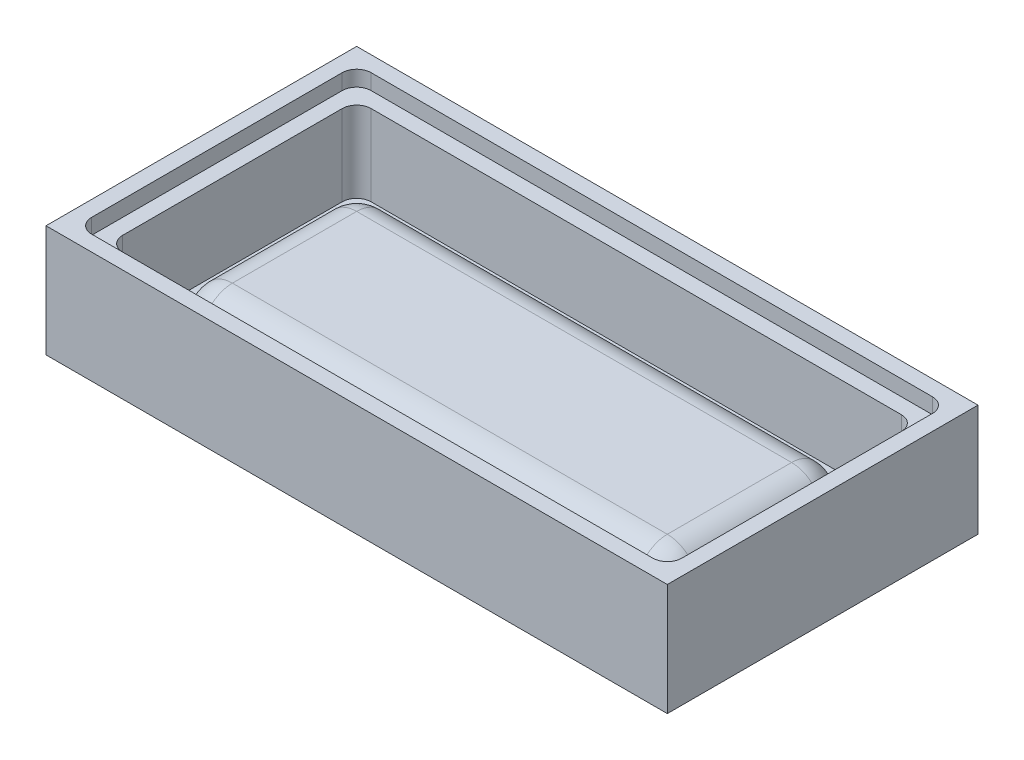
ISO-10303-21;
HEADER;
FILE_DESCRIPTION(('STEP AP214'),'2;1');
FILE_NAME('part.step','',(''),(''),'','','');
FILE_SCHEMA(('AUTOMOTIVE_DESIGN { 1 0 10303 214 1 1 1 1 }'));
ENDSEC;
DATA;
#1=APPLICATION_CONTEXT('core data for automotive mechanical design processes');
#2=APPLICATION_PROTOCOL_DEFINITION('international standard','automotive_design',2000,#1);
#3=PRODUCT_CONTEXT('',#1,'mechanical');
#4=PRODUCT('Part','Part','',(#3));
#5=PRODUCT_RELATED_PRODUCT_CATEGORY('part','',(#4));
#6=PRODUCT_DEFINITION_FORMATION('','',#4);
#7=PRODUCT_DEFINITION_CONTEXT('part definition',#1,'design');
#8=PRODUCT_DEFINITION('design','',#6,#7);
#9=PRODUCT_DEFINITION_SHAPE('','',#8);
#10=(LENGTH_UNIT() NAMED_UNIT(*) SI_UNIT(.MILLI.,.METRE.));
#11=(NAMED_UNIT(*) PLANE_ANGLE_UNIT() SI_UNIT($,.RADIAN.));
#12=(NAMED_UNIT(*) SI_UNIT($,.STERADIAN.) SOLID_ANGLE_UNIT());
#13=UNCERTAINTY_MEASURE_WITH_UNIT(LENGTH_MEASURE(1.E-05),#10,'distance_accuracy_value','');
#14=(GEOMETRIC_REPRESENTATION_CONTEXT(3) GLOBAL_UNCERTAINTY_ASSIGNED_CONTEXT((#13)) GLOBAL_UNIT_ASSIGNED_CONTEXT((#10,
#11,#12)) REPRESENTATION_CONTEXT('',''));
#15=CARTESIAN_POINT('',(0.,0.,0.));
#16=DIRECTION('',(0.,0.,1.));
#17=DIRECTION('',(1.,0.,0.));
#18=AXIS2_PLACEMENT_3D('',#15,#16,#17);
#19=CARTESIAN_POINT('',(85.3357747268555,4.99999999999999,-35.3357747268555));
#20=DIRECTION('',(0.,1.,0.));
#21=DIRECTION('',(0.,0.,1.));
#22=AXIS2_PLACEMENT_3D('',#19,#20,#21);
#23=PLANE('',#22);
#24=CARTESIAN_POINT('',(85.3357747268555,4.99999999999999,-35.3357747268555));
#25=DIRECTION('',(0.,1.,0.));
#26=DIRECTION('',(0.,0.,1.));
#27=AXIS2_PLACEMENT_3D('',#24,#25,#26);
#28=CIRCLE('',#27,4.66422527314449);
#29=CARTESIAN_POINT('',(90.,4.99999999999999,-35.3357747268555));
#30=VERTEX_POINT('',#29);
#31=CARTESIAN_POINT('',(85.3357747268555,4.99999999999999,-40.));
#32=VERTEX_POINT('',#31);
#33=EDGE_CURVE('E239',#30,#32,#28,.T.);
#34=ORIENTED_EDGE('',*,*,#33,.T.);
#35=DIRECTION('',(-1.,0.,0.));
#36=VECTOR('',#35,1.);
#37=CARTESIAN_POINT('',(85.3357747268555,4.99999999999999,-40.));
#38=LINE('',#37,#36);
#39=CARTESIAN_POINT('',(-85.3357747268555,4.99999999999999,-40.));
#40=VERTEX_POINT('',#39);
#41=EDGE_CURVE('E250',#32,#40,#38,.T.);
#42=ORIENTED_EDGE('',*,*,#41,.T.);
#43=CARTESIAN_POINT('',(-85.3357747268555,4.99999999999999,-35.3357747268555));
#44=DIRECTION('',(0.,1.,0.));
#45=DIRECTION('',(0.,0.,-1.));
#46=AXIS2_PLACEMENT_3D('',#43,#44,#45);
#47=CIRCLE('',#46,4.66422527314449);
#48=CARTESIAN_POINT('',(-90.,4.99999999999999,-35.3357747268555));
#49=VERTEX_POINT('',#48);
#50=EDGE_CURVE('E255',#40,#49,#47,.T.);
#51=ORIENTED_EDGE('',*,*,#50,.T.);
#52=DIRECTION('',(0.,0.,1.));
#53=VECTOR('',#52,1.);
#54=CARTESIAN_POINT('',(-90.,4.99999999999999,-35.3357747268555));
#55=LINE('',#54,#53);
#56=CARTESIAN_POINT('',(-90.,4.99999999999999,35.3357747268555));
#57=VERTEX_POINT('',#56);
#58=EDGE_CURVE('E270',#49,#57,#55,.T.);
#59=ORIENTED_EDGE('',*,*,#58,.T.);
#60=CARTESIAN_POINT('',(-85.3357747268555,4.99999999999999,35.3357747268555));
#61=DIRECTION('',(0.,1.,0.));
#62=DIRECTION('',(0.,0.,-1.));
#63=AXIS2_PLACEMENT_3D('',#60,#61,#62);
#64=CIRCLE('',#63,4.66422527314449);
#65=CARTESIAN_POINT('',(-85.3357747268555,4.99999999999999,40.));
#66=VERTEX_POINT('',#65);
#67=EDGE_CURVE('E273',#57,#66,#64,.T.);
#68=ORIENTED_EDGE('',*,*,#67,.T.);
#69=DIRECTION('',(1.,0.,0.));
#70=VECTOR('',#69,1.);
#71=CARTESIAN_POINT('',(-85.3357747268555,4.99999999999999,40.));
#72=LINE('',#71,#70);
#73=CARTESIAN_POINT('',(85.3357747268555,4.99999999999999,40.));
#74=VERTEX_POINT('',#73);
#75=EDGE_CURVE('E276',#66,#74,#72,.T.);
#76=ORIENTED_EDGE('',*,*,#75,.T.);
#77=CARTESIAN_POINT('',(85.3357747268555,4.99999999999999,35.3357747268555));
#78=DIRECTION('',(0.,1.,0.));
#79=DIRECTION('',(0.,0.,-1.));
#80=AXIS2_PLACEMENT_3D('',#77,#78,#79);
#81=CIRCLE('',#80,4.66422527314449);
#82=CARTESIAN_POINT('',(90.,4.99999999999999,35.3357747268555));
#83=VERTEX_POINT('',#82);
#84=EDGE_CURVE('E279',#74,#83,#81,.T.);
#85=ORIENTED_EDGE('',*,*,#84,.T.);
#86=DIRECTION('',(0.,0.,-1.));
#87=VECTOR('',#86,1.);
#88=CARTESIAN_POINT('',(90.,4.99999999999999,35.3357747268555));
#89=LINE('',#88,#87);
#90=EDGE_CURVE('E247',#83,#30,#89,.T.);
#91=ORIENTED_EDGE('',*,*,#90,.T.);
#92=EDGE_LOOP('',(#34,#42,#51,#59,#68,#76,#85,#91));
#93=FACE_BOUND('',#92,.T.);
#94=DIRECTION('',(1.,0.,0.));
#95=VECTOR('',#94,1.);
#96=CARTESIAN_POINT('',(-80.,4.99999999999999,30.));
#97=LINE('',#96,#95);
#98=CARTESIAN_POINT('',(-70.,4.99999999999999,30.));
#99=VERTEX_POINT('',#98);
#100=CARTESIAN_POINT('',(70.,4.99999999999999,30.));
#101=VERTEX_POINT('',#100);
#102=EDGE_CURVE('E478',#99,#101,#97,.T.);
#103=ORIENTED_EDGE('',*,*,#102,.F.);
#104=CARTESIAN_POINT('',(-70.,4.99999999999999,20.));
#105=DIRECTION('',(0.,1.,0.));
#106=DIRECTION('',(0.,0.,1.));
#107=AXIS2_PLACEMENT_3D('',#104,#105,#106);
#108=CIRCLE('',#107,10.);
#109=CARTESIAN_POINT('',(-80.,4.99999999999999,20.));
#110=VERTEX_POINT('',#109);
#111=EDGE_CURVE('E46',#99,#110,#108,.F.);
#112=ORIENTED_EDGE('',*,*,#111,.T.);
#113=DIRECTION('',(0.,0.,1.));
#114=VECTOR('',#113,1.);
#115=CARTESIAN_POINT('',(-80.,4.99999999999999,-30.));
#116=LINE('',#115,#114);
#117=CARTESIAN_POINT('',(-80.,4.99999999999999,-20.));
#118=VERTEX_POINT('',#117);
#119=EDGE_CURVE('E476',#118,#110,#116,.T.);
#120=ORIENTED_EDGE('',*,*,#119,.F.);
#121=CARTESIAN_POINT('',(-70.,4.99999999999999,-20.));
#122=DIRECTION('',(0.,1.,0.));
#123=DIRECTION('',(0.,0.,1.));
#124=AXIS2_PLACEMENT_3D('',#121,#122,#123);
#125=CIRCLE('',#124,10.);
#126=CARTESIAN_POINT('',(-70.,4.99999999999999,-30.));
#127=VERTEX_POINT('',#126);
#128=EDGE_CURVE('E11',#118,#127,#125,.F.);
#129=ORIENTED_EDGE('',*,*,#128,.T.);
#130=DIRECTION('',(-1.,0.,0.));
#131=VECTOR('',#130,1.);
#132=CARTESIAN_POINT('',(80.,4.99999999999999,-30.));
#133=LINE('',#132,#131);
#134=CARTESIAN_POINT('',(70.,4.99999999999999,-30.));
#135=VERTEX_POINT('',#134);
#136=EDGE_CURVE('E266',#135,#127,#133,.T.);
#137=ORIENTED_EDGE('',*,*,#136,.F.);
#138=CARTESIAN_POINT('',(70.,4.99999999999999,-20.));
#139=DIRECTION('',(0.,1.,0.));
#140=DIRECTION('',(0.,0.,1.));
#141=AXIS2_PLACEMENT_3D('',#138,#139,#140);
#142=CIRCLE('',#141,10.);
#143=CARTESIAN_POINT('',(80.,4.99999999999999,-20.));
#144=VERTEX_POINT('',#143);
#145=EDGE_CURVE('E440',#135,#144,#142,.F.);
#146=ORIENTED_EDGE('',*,*,#145,.T.);
#147=DIRECTION('',(0.,0.,-1.));
#148=VECTOR('',#147,1.);
#149=CARTESIAN_POINT('',(80.,4.99999999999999,30.));
#150=LINE('',#149,#148);
#151=CARTESIAN_POINT('',(80.,4.99999999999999,20.));
#152=VERTEX_POINT('',#151);
#153=EDGE_CURVE('E482',#152,#144,#150,.T.);
#154=ORIENTED_EDGE('',*,*,#153,.F.);
#155=CARTESIAN_POINT('',(70.,4.99999999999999,20.));
#156=DIRECTION('',(0.,1.,0.));
#157=DIRECTION('',(0.,0.,1.));
#158=AXIS2_PLACEMENT_3D('',#155,#156,#157);
#159=CIRCLE('',#158,10.);
#160=EDGE_CURVE('E438',#152,#101,#159,.F.);
#161=ORIENTED_EDGE('',*,*,#160,.T.);
#162=EDGE_LOOP('',(#103,#112,#120,#129,#137,#146,#154,#161));
#163=FACE_BOUND('',#162,.T.);
#164=ADVANCED_FACE('F37',(#93,#163),#23,.T.);
#165=CARTESIAN_POINT('',(90.3357747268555,31.,-40.3357747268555));
#166=DIRECTION('',(0.,-1.,0.));
#167=DIRECTION('',(0.,0.,-1.));
#168=AXIS2_PLACEMENT_3D('',#165,#166,#167);
#169=PLANE('',#168);
#170=CARTESIAN_POINT('',(90.3357747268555,31.,-40.3357747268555));
#171=DIRECTION('',(0.,1.,0.));
#172=DIRECTION('',(0.,0.,-1.));
#173=AXIS2_PLACEMENT_3D('',#170,#171,#172);
#174=CIRCLE('',#173,4.6642252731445);
#175=CARTESIAN_POINT('',(95.,31.,-40.3357747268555));
#176=VERTEX_POINT('',#175);
#177=CARTESIAN_POINT('',(90.3357747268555,31.,-45.));
#178=VERTEX_POINT('',#177);
#179=EDGE_CURVE('E313',#176,#178,#174,.T.);
#180=ORIENTED_EDGE('',*,*,#179,.T.);
#181=DIRECTION('',(-1.,0.,0.));
#182=VECTOR('',#181,1.);
#183=CARTESIAN_POINT('',(-90.3357747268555,31.,-45.));
#184=LINE('',#183,#182);
#185=CARTESIAN_POINT('',(-90.3357747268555,31.,-45.));
#186=VERTEX_POINT('',#185);
#187=EDGE_CURVE('E316',#178,#186,#184,.T.);
#188=ORIENTED_EDGE('',*,*,#187,.T.);
#189=CARTESIAN_POINT('',(-90.3357747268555,31.,-40.3357747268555));
#190=DIRECTION('',(0.,1.,0.));
#191=DIRECTION('',(0.,0.,1.));
#192=AXIS2_PLACEMENT_3D('',#189,#190,#191);
#193=CIRCLE('',#192,4.66422527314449);
#194=CARTESIAN_POINT('',(-95.,31.,-40.3357747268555));
#195=VERTEX_POINT('',#194);
#196=EDGE_CURVE('E320',#186,#195,#193,.T.);
#197=ORIENTED_EDGE('',*,*,#196,.T.);
#198=DIRECTION('',(0.,0.,1.));
#199=VECTOR('',#198,1.);
#200=CARTESIAN_POINT('',(-95.,31.,-40.3357747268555));
#201=LINE('',#200,#199);
#202=CARTESIAN_POINT('',(-95.,31.,40.3357747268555));
#203=VERTEX_POINT('',#202);
#204=EDGE_CURVE('E323',#195,#203,#201,.T.);
#205=ORIENTED_EDGE('',*,*,#204,.T.);
#206=CARTESIAN_POINT('',(-90.3357747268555,31.,40.3357747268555));
#207=DIRECTION('',(0.,1.,0.));
#208=DIRECTION('',(0.,0.,1.));
#209=AXIS2_PLACEMENT_3D('',#206,#207,#208);
#210=CIRCLE('',#209,4.66422527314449);
#211=CARTESIAN_POINT('',(-90.3357747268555,31.,45.));
#212=VERTEX_POINT('',#211);
#213=EDGE_CURVE('E326',#203,#212,#210,.T.);
#214=ORIENTED_EDGE('',*,*,#213,.T.);
#215=DIRECTION('',(1.,0.,0.));
#216=VECTOR('',#215,1.);
#217=CARTESIAN_POINT('',(-90.3357747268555,31.,45.));
#218=LINE('',#217,#216);
#219=CARTESIAN_POINT('',(90.3357747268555,31.,45.));
#220=VERTEX_POINT('',#219);
#221=EDGE_CURVE('E329',#212,#220,#218,.T.);
#222=ORIENTED_EDGE('',*,*,#221,.T.);
#223=CARTESIAN_POINT('',(90.3357747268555,31.,40.3357747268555));
#224=DIRECTION('',(0.,1.,0.));
#225=DIRECTION('',(0.,0.,1.));
#226=AXIS2_PLACEMENT_3D('',#223,#224,#225);
#227=CIRCLE('',#226,4.66422527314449);
#228=CARTESIAN_POINT('',(95.,31.,40.3357747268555));
#229=VERTEX_POINT('',#228);
#230=EDGE_CURVE('E332',#220,#229,#227,.T.);
#231=ORIENTED_EDGE('',*,*,#230,.T.);
#232=DIRECTION('',(0.,0.,-1.));
#233=VECTOR('',#232,1.);
#234=CARTESIAN_POINT('',(95.,31.,-40.3357747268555));
#235=LINE('',#234,#233);
#236=EDGE_CURVE('E335',#229,#176,#235,.T.);
#237=ORIENTED_EDGE('',*,*,#236,.T.);
#238=EDGE_LOOP('',(#180,#188,#197,#205,#214,#222,#231,#237));
#239=FACE_BOUND('',#238,.T.);
#240=CARTESIAN_POINT('',(85.3357747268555,31.,-35.3357747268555));
#241=DIRECTION('',(0.,1.,0.));
#242=DIRECTION('',(0.,0.,1.));
#243=AXIS2_PLACEMENT_3D('',#240,#241,#242);
#244=CIRCLE('',#243,4.66422527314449);
#245=CARTESIAN_POINT('',(90.,31.,-35.3357747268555));
#246=VERTEX_POINT('',#245);
#247=CARTESIAN_POINT('',(85.3357747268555,31.,-40.));
#248=VERTEX_POINT('',#247);
#249=EDGE_CURVE('E242',#246,#248,#244,.T.);
#250=ORIENTED_EDGE('',*,*,#249,.F.);
#251=DIRECTION('',(0.,0.,-1.));
#252=VECTOR('',#251,1.);
#253=CARTESIAN_POINT('',(90.,31.,35.3357747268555));
#254=LINE('',#253,#252);
#255=CARTESIAN_POINT('',(90.,31.,35.3357747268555));
#256=VERTEX_POINT('',#255);
#257=EDGE_CURVE('E260',#256,#246,#254,.T.);
#258=ORIENTED_EDGE('',*,*,#257,.F.);
#259=CARTESIAN_POINT('',(85.3357747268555,31.,35.3357747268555));
#260=DIRECTION('',(0.,1.,0.));
#261=DIRECTION('',(0.,0.,-1.));
#262=AXIS2_PLACEMENT_3D('',#259,#260,#261);
#263=CIRCLE('',#262,4.66422527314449);
#264=CARTESIAN_POINT('',(85.3357747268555,31.,40.));
#265=VERTEX_POINT('',#264);
#266=EDGE_CURVE('E263',#265,#256,#263,.T.);
#267=ORIENTED_EDGE('',*,*,#266,.F.);
#268=DIRECTION('',(1.,0.,0.));
#269=VECTOR('',#268,1.);
#270=CARTESIAN_POINT('',(-85.3357747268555,31.,40.));
#271=LINE('',#270,#269);
#272=CARTESIAN_POINT('',(-85.3357747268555,31.,40.));
#273=VERTEX_POINT('',#272);
#274=EDGE_CURVE('E294',#273,#265,#271,.T.);
#275=ORIENTED_EDGE('',*,*,#274,.F.);
#276=CARTESIAN_POINT('',(-85.3357747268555,31.,35.3357747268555));
#277=DIRECTION('',(0.,1.,0.));
#278=DIRECTION('',(0.,0.,-1.));
#279=AXIS2_PLACEMENT_3D('',#276,#277,#278);
#280=CIRCLE('',#279,4.66422527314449);
#281=CARTESIAN_POINT('',(-90.,31.,35.3357747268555));
#282=VERTEX_POINT('',#281);
#283=EDGE_CURVE('E291',#282,#273,#280,.T.);
#284=ORIENTED_EDGE('',*,*,#283,.F.);
#285=DIRECTION('',(0.,0.,1.));
#286=VECTOR('',#285,1.);
#287=CARTESIAN_POINT('',(-90.,31.,-35.3357747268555));
#288=LINE('',#287,#286);
#289=CARTESIAN_POINT('',(-90.,31.,-35.3357747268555));
#290=VERTEX_POINT('',#289);
#291=EDGE_CURVE('E288',#290,#282,#288,.T.);
#292=ORIENTED_EDGE('',*,*,#291,.F.);
#293=CARTESIAN_POINT('',(-85.3357747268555,31.,-35.3357747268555));
#294=DIRECTION('',(0.,1.,0.));
#295=DIRECTION('',(0.,0.,-1.));
#296=AXIS2_PLACEMENT_3D('',#293,#294,#295);
#297=CIRCLE('',#296,4.66422527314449);
#298=CARTESIAN_POINT('',(-85.3357747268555,31.,-40.));
#299=VERTEX_POINT('',#298);
#300=EDGE_CURVE('E285',#299,#290,#297,.T.);
#301=ORIENTED_EDGE('',*,*,#300,.F.);
#302=DIRECTION('',(-1.,0.,0.));
#303=VECTOR('',#302,1.);
#304=CARTESIAN_POINT('',(85.3357747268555,31.,-40.));
#305=LINE('',#304,#303);
#306=EDGE_CURVE('E283',#248,#299,#305,.T.);
#307=ORIENTED_EDGE('',*,*,#306,.F.);
#308=EDGE_LOOP('',(#250,#258,#267,#275,#284,#292,#301,#307));
#309=FACE_BOUND('',#308,.T.);
#310=ADVANCED_FACE('F551',(#239,#309),#169,.F.);
#311=CARTESIAN_POINT('',(100.,36.,-50.));
#312=DIRECTION('',(-1.,0.,0.));
#313=DIRECTION('',(0.,0.,1.));
#314=AXIS2_PLACEMENT_3D('',#311,#312,#313);
#315=PLANE('',#314);
#316=DIRECTION('',(0.,0.,-1.));
#317=VECTOR('',#316,1.);
#318=CARTESIAN_POINT('',(100.,0.,-50.));
#319=LINE('',#318,#317);
#320=CARTESIAN_POINT('',(100.,0.,50.));
#321=VERTEX_POINT('',#320);
#322=CARTESIAN_POINT('',(100.,0.,-50.));
#323=VERTEX_POINT('',#322);
#324=EDGE_CURVE('E362',#321,#323,#319,.T.);
#325=ORIENTED_EDGE('',*,*,#324,.T.);
#326=DIRECTION('',(0.,-1.,0.));
#327=VECTOR('',#326,1.);
#328=CARTESIAN_POINT('',(100.,36.,-50.));
#329=LINE('',#328,#327);
#330=CARTESIAN_POINT('',(100.,36.,-50.));
#331=VERTEX_POINT('',#330);
#332=EDGE_CURVE('E403',#331,#323,#329,.T.);
#333=ORIENTED_EDGE('',*,*,#332,.F.);
#334=DIRECTION('',(0.,0.,-1.));
#335=VECTOR('',#334,1.);
#336=CARTESIAN_POINT('',(100.,36.,-50.));
#337=LINE('',#336,#335);
#338=CARTESIAN_POINT('',(100.,36.,50.));
#339=VERTEX_POINT('',#338);
#340=EDGE_CURVE('E377',#339,#331,#337,.T.);
#341=ORIENTED_EDGE('',*,*,#340,.F.);
#342=DIRECTION('',(0.,-1.,0.));
#343=VECTOR('',#342,1.);
#344=CARTESIAN_POINT('',(100.,36.,50.));
#345=LINE('',#344,#343);
#346=EDGE_CURVE('E387',#339,#321,#345,.T.);
#347=ORIENTED_EDGE('',*,*,#346,.T.);
#348=EDGE_LOOP('',(#325,#333,#341,#347));
#349=FACE_BOUND('',#348,.T.);
#350=ADVANCED_FACE('F556',(#349),#315,.F.);
#351=CARTESIAN_POINT('',(-100.,36.,-50.));
#352=DIRECTION('',(0.,0.,1.));
#353=DIRECTION('',(1.,0.,0.));
#354=AXIS2_PLACEMENT_3D('',#351,#352,#353);
#355=PLANE('',#354);
#356=DIRECTION('',(-1.,0.,0.));
#357=VECTOR('',#356,1.);
#358=CARTESIAN_POINT('',(-100.,0.,-50.));
#359=LINE('',#358,#357);
#360=CARTESIAN_POINT('',(-100.,0.,-50.));
#361=VERTEX_POINT('',#360);
#362=EDGE_CURVE('E390',#323,#361,#359,.T.);
#363=ORIENTED_EDGE('',*,*,#362,.T.);
#364=DIRECTION('',(0.,-1.,0.));
#365=VECTOR('',#364,1.);
#366=CARTESIAN_POINT('',(-100.,36.,-50.));
#367=LINE('',#366,#365);
#368=CARTESIAN_POINT('',(-100.,36.,-50.));
#369=VERTEX_POINT('',#368);
#370=EDGE_CURVE('E400',#369,#361,#367,.T.);
#371=ORIENTED_EDGE('',*,*,#370,.F.);
#372=DIRECTION('',(-1.,0.,0.));
#373=VECTOR('',#372,1.);
#374=CARTESIAN_POINT('',(-100.,36.,-50.));
#375=LINE('',#374,#373);
#376=EDGE_CURVE('E380',#331,#369,#375,.T.);
#377=ORIENTED_EDGE('',*,*,#376,.F.);
#378=ORIENTED_EDGE('',*,*,#332,.T.);
#379=EDGE_LOOP('',(#363,#371,#377,#378));
#380=FACE_BOUND('',#379,.T.);
#381=ADVANCED_FACE('F638',(#380),#355,.F.);
#382=CARTESIAN_POINT('',(-100.,36.,-50.));
#383=DIRECTION('',(1.,0.,0.));
#384=DIRECTION('',(0.,0.,-1.));
#385=AXIS2_PLACEMENT_3D('',#382,#383,#384);
#386=PLANE('',#385);
#387=DIRECTION('',(0.,0.,1.));
#388=VECTOR('',#387,1.);
#389=CARTESIAN_POINT('',(-100.,0.,-50.));
#390=LINE('',#389,#388);
#391=CARTESIAN_POINT('',(-100.,0.,50.));
#392=VERTEX_POINT('',#391);
#393=EDGE_CURVE('E392',#361,#392,#390,.T.);
#394=ORIENTED_EDGE('',*,*,#393,.T.);
#395=DIRECTION('',(0.,-1.,0.));
#396=VECTOR('',#395,1.);
#397=CARTESIAN_POINT('',(-100.,36.,50.));
#398=LINE('',#397,#396);
#399=CARTESIAN_POINT('',(-100.,36.,50.));
#400=VERTEX_POINT('',#399);
#401=EDGE_CURVE('E397',#400,#392,#398,.T.);
#402=ORIENTED_EDGE('',*,*,#401,.F.);
#403=DIRECTION('',(0.,0.,1.));
#404=VECTOR('',#403,1.);
#405=CARTESIAN_POINT('',(-100.,36.,-50.));
#406=LINE('',#405,#404);
#407=EDGE_CURVE('E383',#369,#400,#406,.T.);
#408=ORIENTED_EDGE('',*,*,#407,.F.);
#409=ORIENTED_EDGE('',*,*,#370,.T.);
#410=EDGE_LOOP('',(#394,#402,#408,#409));
#411=FACE_BOUND('',#410,.T.);
#412=ADVANCED_FACE('F634',(#411),#386,.F.);
#413=CARTESIAN_POINT('',(-100.,36.,50.));
#414=DIRECTION('',(0.,0.,-1.));
#415=DIRECTION('',(-1.,0.,0.));
#416=AXIS2_PLACEMENT_3D('',#413,#414,#415);
#417=PLANE('',#416);
#418=DIRECTION('',(1.,0.,0.));
#419=VECTOR('',#418,1.);
#420=CARTESIAN_POINT('',(-100.,0.,50.));
#421=LINE('',#420,#419);
#422=EDGE_CURVE('E381',#392,#321,#421,.T.);
#423=ORIENTED_EDGE('',*,*,#422,.T.);
#424=ORIENTED_EDGE('',*,*,#346,.F.);
#425=DIRECTION('',(1.,0.,0.));
#426=VECTOR('',#425,1.);
#427=CARTESIAN_POINT('',(-100.,36.,50.));
#428=LINE('',#427,#426);
#429=EDGE_CURVE('E385',#400,#339,#428,.T.);
#430=ORIENTED_EDGE('',*,*,#429,.F.);
#431=ORIENTED_EDGE('',*,*,#401,.T.);
#432=EDGE_LOOP('',(#423,#424,#430,#431));
#433=FACE_BOUND('',#432,.T.);
#434=ADVANCED_FACE('F627',(#433),#417,.F.);
#435=CARTESIAN_POINT('',(0.,36.,0.));
#436=DIRECTION('',(0.,1.,0.));
#437=DIRECTION('',(0.,0.,1.));
#438=AXIS2_PLACEMENT_3D('',#435,#436,#437);
#439=PLANE('',#438);
#440=CARTESIAN_POINT('',(90.3357747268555,36.,-40.3357747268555));
#441=DIRECTION('',(0.,1.,0.));
#442=DIRECTION('',(0.,0.,-1.));
#443=AXIS2_PLACEMENT_3D('',#440,#441,#442);
#444=CIRCLE('',#443,4.6642252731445);
#445=CARTESIAN_POINT('',(95.,36.,-40.3357747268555));
#446=VERTEX_POINT('',#445);
#447=CARTESIAN_POINT('',(90.3357747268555,36.,-45.));
#448=VERTEX_POINT('',#447);
#449=EDGE_CURVE('E300',#446,#448,#444,.T.);
#450=ORIENTED_EDGE('',*,*,#449,.F.);
#451=DIRECTION('',(0.,0.,-1.));
#452=VECTOR('',#451,1.);
#453=CARTESIAN_POINT('',(95.,36.,-40.3357747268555));
#454=LINE('',#453,#452);
#455=CARTESIAN_POINT('',(95.,36.,40.3357747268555));
#456=VERTEX_POINT('',#455);
#457=EDGE_CURVE('E317',#456,#446,#454,.T.);
#458=ORIENTED_EDGE('',*,*,#457,.F.);
#459=CARTESIAN_POINT('',(90.3357747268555,36.,40.3357747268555));
#460=DIRECTION('',(0.,1.,0.));
#461=DIRECTION('',(0.,0.,1.));
#462=AXIS2_PLACEMENT_3D('',#459,#460,#461);
#463=CIRCLE('',#462,4.66422527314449);
#464=CARTESIAN_POINT('',(90.3357747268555,36.,45.));
#465=VERTEX_POINT('',#464);
#466=EDGE_CURVE('E355',#465,#456,#463,.T.);
#467=ORIENTED_EDGE('',*,*,#466,.F.);
#468=DIRECTION('',(1.,0.,0.));
#469=VECTOR('',#468,1.);
#470=CARTESIAN_POINT('',(-90.3357747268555,36.,45.));
#471=LINE('',#470,#469);
#472=CARTESIAN_POINT('',(-90.3357747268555,36.,45.));
#473=VERTEX_POINT('',#472);
#474=EDGE_CURVE('E352',#473,#465,#471,.T.);
#475=ORIENTED_EDGE('',*,*,#474,.F.);
#476=CARTESIAN_POINT('',(-90.3357747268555,36.,40.3357747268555));
#477=DIRECTION('',(0.,1.,0.));
#478=DIRECTION('',(0.,0.,1.));
#479=AXIS2_PLACEMENT_3D('',#476,#477,#478);
#480=CIRCLE('',#479,4.66422527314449);
#481=CARTESIAN_POINT('',(-95.,36.,40.3357747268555));
#482=VERTEX_POINT('',#481);
#483=EDGE_CURVE('E349',#482,#473,#480,.T.);
#484=ORIENTED_EDGE('',*,*,#483,.F.);
#485=DIRECTION('',(0.,0.,1.));
#486=VECTOR('',#485,1.);
#487=CARTESIAN_POINT('',(-95.,36.,-40.3357747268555));
#488=LINE('',#487,#486);
#489=CARTESIAN_POINT('',(-95.,36.,-40.3357747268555));
#490=VERTEX_POINT('',#489);
#491=EDGE_CURVE('E346',#490,#482,#488,.T.);
#492=ORIENTED_EDGE('',*,*,#491,.F.);
#493=CARTESIAN_POINT('',(-90.3357747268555,36.,-40.3357747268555));
#494=DIRECTION('',(0.,1.,0.));
#495=DIRECTION('',(0.,0.,1.));
#496=AXIS2_PLACEMENT_3D('',#493,#494,#495);
#497=CIRCLE('',#496,4.66422527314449);
#498=CARTESIAN_POINT('',(-90.3357747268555,36.,-45.));
#499=VERTEX_POINT('',#498);
#500=EDGE_CURVE('E343',#499,#490,#497,.T.);
#501=ORIENTED_EDGE('',*,*,#500,.F.);
#502=DIRECTION('',(-1.,0.,0.));
#503=VECTOR('',#502,1.);
#504=CARTESIAN_POINT('',(-90.3357747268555,36.,-45.));
#505=LINE('',#504,#503);
#506=EDGE_CURVE('E340',#448,#499,#505,.T.);
#507=ORIENTED_EDGE('',*,*,#506,.F.);
#508=EDGE_LOOP('',(#450,#458,#467,#475,#484,#492,#501,#507));
#509=FACE_BOUND('',#508,.T.);
#510=ORIENTED_EDGE('',*,*,#340,.T.);
#511=ORIENTED_EDGE('',*,*,#376,.T.);
#512=ORIENTED_EDGE('',*,*,#407,.T.);
#513=ORIENTED_EDGE('',*,*,#429,.T.);
#514=EDGE_LOOP('',(#510,#511,#512,#513));
#515=FACE_BOUND('',#514,.T.);
#516=ADVANCED_FACE('F624',(#509,#515),#439,.T.);
#517=CARTESIAN_POINT('',(0.,0.,0.));
#518=DIRECTION('',(0.,1.,0.));
#519=DIRECTION('',(0.,0.,1.));
#520=AXIS2_PLACEMENT_3D('',#517,#518,#519);
#521=PLANE('',#520);
#522=ORIENTED_EDGE('',*,*,#324,.F.);
#523=ORIENTED_EDGE('',*,*,#422,.F.);
#524=ORIENTED_EDGE('',*,*,#393,.F.);
#525=ORIENTED_EDGE('',*,*,#362,.F.);
#526=EDGE_LOOP('',(#522,#523,#524,#525));
#527=FACE_BOUND('',#526,.T.);
#528=ADVANCED_FACE('F622',(#527),#521,.F.);
#529=CARTESIAN_POINT('',(90.3357747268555,31.,-40.3357747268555));
#530=DIRECTION('',(0.,1.,0.));
#531=DIRECTION('',(0.,0.,1.));
#532=AXIS2_PLACEMENT_3D('',#529,#530,#531);
#533=CYLINDRICAL_SURFACE('',#532,4.6642252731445);
#534=ORIENTED_EDGE('',*,*,#449,.T.);
#535=DIRECTION('',(0.,1.,0.));
#536=VECTOR('',#535,1.);
#537=CARTESIAN_POINT('',(90.3357747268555,31.,-45.));
#538=LINE('',#537,#536);
#539=EDGE_CURVE('E338',#178,#448,#538,.T.);
#540=ORIENTED_EDGE('',*,*,#539,.F.);
#541=ORIENTED_EDGE('',*,*,#179,.F.);
#542=DIRECTION('',(0.,1.,0.));
#543=VECTOR('',#542,1.);
#544=CARTESIAN_POINT('',(95.,31.,-40.3357747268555));
#545=LINE('',#544,#543);
#546=EDGE_CURVE('E360',#176,#446,#545,.T.);
#547=ORIENTED_EDGE('',*,*,#546,.T.);
#548=EDGE_LOOP('',(#534,#540,#541,#547));
#549=FACE_BOUND('',#548,.T.);
#550=ADVANCED_FACE('F596',(#549),#533,.F.);
#551=CARTESIAN_POINT('',(95.,31.,-40.3357747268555));
#552=DIRECTION('',(1.,0.,0.));
#553=DIRECTION('',(0.,0.,-1.));
#554=AXIS2_PLACEMENT_3D('',#551,#552,#553);
#555=PLANE('',#554);
#556=ORIENTED_EDGE('',*,*,#457,.T.);
#557=ORIENTED_EDGE('',*,*,#546,.F.);
#558=ORIENTED_EDGE('',*,*,#236,.F.);
#559=DIRECTION('',(0.,1.,0.));
#560=VECTOR('',#559,1.);
#561=CARTESIAN_POINT('',(95.,31.,40.3357747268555));
#562=LINE('',#561,#560);
#563=EDGE_CURVE('E363',#229,#456,#562,.T.);
#564=ORIENTED_EDGE('',*,*,#563,.T.);
#565=EDGE_LOOP('',(#556,#557,#558,#564));
#566=FACE_BOUND('',#565,.T.);
#567=ADVANCED_FACE('F592',(#566),#555,.F.);
#568=CARTESIAN_POINT('',(90.3357747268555,31.,40.3357747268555));
#569=DIRECTION('',(0.,1.,0.));
#570=DIRECTION('',(0.,0.,1.));
#571=AXIS2_PLACEMENT_3D('',#568,#569,#570);
#572=CYLINDRICAL_SURFACE('',#571,4.66422527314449);
#573=ORIENTED_EDGE('',*,*,#466,.T.);
#574=ORIENTED_EDGE('',*,*,#563,.F.);
#575=ORIENTED_EDGE('',*,*,#230,.F.);
#576=DIRECTION('',(0.,1.,0.));
#577=VECTOR('',#576,1.);
#578=CARTESIAN_POINT('',(90.3357747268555,31.,45.));
#579=LINE('',#578,#577);
#580=EDGE_CURVE('E365',#220,#465,#579,.T.);
#581=ORIENTED_EDGE('',*,*,#580,.T.);
#582=EDGE_LOOP('',(#573,#574,#575,#581));
#583=FACE_BOUND('',#582,.T.);
#584=ADVANCED_FACE('F595',(#583),#572,.F.);
#585=CARTESIAN_POINT('',(-90.3357747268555,31.,45.));
#586=DIRECTION('',(0.,0.,1.));
#587=DIRECTION('',(1.,0.,0.));
#588=AXIS2_PLACEMENT_3D('',#585,#586,#587);
#589=PLANE('',#588);
#590=ORIENTED_EDGE('',*,*,#474,.T.);
#591=ORIENTED_EDGE('',*,*,#580,.F.);
#592=ORIENTED_EDGE('',*,*,#221,.F.);
#593=DIRECTION('',(0.,1.,0.));
#594=VECTOR('',#593,1.);
#595=CARTESIAN_POINT('',(-90.3357747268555,31.,45.));
#596=LINE('',#595,#594);
#597=EDGE_CURVE('E367',#212,#473,#596,.T.);
#598=ORIENTED_EDGE('',*,*,#597,.T.);
#599=EDGE_LOOP('',(#590,#591,#592,#598));
#600=FACE_BOUND('',#599,.T.);
#601=ADVANCED_FACE('F600',(#600),#589,.F.);
#602=CARTESIAN_POINT('',(-90.3357747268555,31.,40.3357747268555));
#603=DIRECTION('',(0.,1.,0.));
#604=DIRECTION('',(0.,0.,1.));
#605=AXIS2_PLACEMENT_3D('',#602,#603,#604);
#606=CYLINDRICAL_SURFACE('',#605,4.66422527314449);
#607=ORIENTED_EDGE('',*,*,#483,.T.);
#608=ORIENTED_EDGE('',*,*,#597,.F.);
#609=ORIENTED_EDGE('',*,*,#213,.F.);
#610=DIRECTION('',(0.,1.,0.));
#611=VECTOR('',#610,1.);
#612=CARTESIAN_POINT('',(-95.,31.,40.3357747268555));
#613=LINE('',#612,#611);
#614=EDGE_CURVE('E369',#203,#482,#613,.T.);
#615=ORIENTED_EDGE('',*,*,#614,.T.);
#616=EDGE_LOOP('',(#607,#608,#609,#615));
#617=FACE_BOUND('',#616,.T.);
#618=ADVANCED_FACE('F604',(#617),#606,.F.);
#619=CARTESIAN_POINT('',(-95.,31.,-40.3357747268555));
#620=DIRECTION('',(-1.,0.,0.));
#621=DIRECTION('',(0.,0.,1.));
#622=AXIS2_PLACEMENT_3D('',#619,#620,#621);
#623=PLANE('',#622);
#624=ORIENTED_EDGE('',*,*,#491,.T.);
#625=ORIENTED_EDGE('',*,*,#614,.F.);
#626=ORIENTED_EDGE('',*,*,#204,.F.);
#627=DIRECTION('',(0.,1.,0.));
#628=VECTOR('',#627,1.);
#629=CARTESIAN_POINT('',(-95.,31.,-40.3357747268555));
#630=LINE('',#629,#628);
#631=EDGE_CURVE('E371',#195,#490,#630,.T.);
#632=ORIENTED_EDGE('',*,*,#631,.T.);
#633=EDGE_LOOP('',(#624,#625,#626,#632));
#634=FACE_BOUND('',#633,.T.);
#635=ADVANCED_FACE('F608',(#634),#623,.F.);
#636=CARTESIAN_POINT('',(-90.3357747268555,31.,-40.3357747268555));
#637=DIRECTION('',(0.,1.,0.));
#638=DIRECTION('',(0.,0.,1.));
#639=AXIS2_PLACEMENT_3D('',#636,#637,#638);
#640=CYLINDRICAL_SURFACE('',#639,4.66422527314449);
#641=ORIENTED_EDGE('',*,*,#500,.T.);
#642=ORIENTED_EDGE('',*,*,#631,.F.);
#643=ORIENTED_EDGE('',*,*,#196,.F.);
#644=DIRECTION('',(0.,1.,0.));
#645=VECTOR('',#644,1.);
#646=CARTESIAN_POINT('',(-90.3357747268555,31.,-45.));
#647=LINE('',#646,#645);
#648=EDGE_CURVE('E373',#186,#499,#647,.T.);
#649=ORIENTED_EDGE('',*,*,#648,.T.);
#650=EDGE_LOOP('',(#641,#642,#643,#649));
#651=FACE_BOUND('',#650,.T.);
#652=ADVANCED_FACE('F612',(#651),#640,.F.);
#653=CARTESIAN_POINT('',(-90.3357747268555,31.,-45.));
#654=DIRECTION('',(0.,0.,-1.));
#655=DIRECTION('',(-1.,0.,0.));
#656=AXIS2_PLACEMENT_3D('',#653,#654,#655);
#657=PLANE('',#656);
#658=ORIENTED_EDGE('',*,*,#506,.T.);
#659=ORIENTED_EDGE('',*,*,#648,.F.);
#660=ORIENTED_EDGE('',*,*,#187,.F.);
#661=ORIENTED_EDGE('',*,*,#539,.T.);
#662=EDGE_LOOP('',(#658,#659,#660,#661));
#663=FACE_BOUND('',#662,.T.);
#664=ADVANCED_FACE('F590',(#663),#657,.F.);
#665=CARTESIAN_POINT('',(85.3357747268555,4.99999999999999,-35.3357747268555));
#666=DIRECTION('',(0.,1.,0.));
#667=DIRECTION('',(0.,0.,1.));
#668=AXIS2_PLACEMENT_3D('',#665,#666,#667);
#669=CYLINDRICAL_SURFACE('',#668,4.66422527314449);
#670=ORIENTED_EDGE('',*,*,#249,.T.);
#671=DIRECTION('',(0.,1.,0.));
#672=VECTOR('',#671,1.);
#673=CARTESIAN_POINT('',(85.3357747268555,4.99999999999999,-40.));
#674=LINE('',#673,#672);
#675=EDGE_CURVE('E235',#32,#248,#674,.T.);
#676=ORIENTED_EDGE('',*,*,#675,.F.);
#677=ORIENTED_EDGE('',*,*,#33,.F.);
#678=DIRECTION('',(0.,1.,0.));
#679=VECTOR('',#678,1.);
#680=CARTESIAN_POINT('',(90.,4.99999999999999,-35.3357747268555));
#681=LINE('',#680,#679);
#682=EDGE_CURVE('E298',#30,#246,#681,.T.);
#683=ORIENTED_EDGE('',*,*,#682,.T.);
#684=EDGE_LOOP('',(#670,#676,#677,#683));
#685=FACE_BOUND('',#684,.T.);
#686=ADVANCED_FACE('F237',(#685),#669,.F.);
#687=CARTESIAN_POINT('',(90.,4.99999999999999,35.3357747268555));
#688=DIRECTION('',(1.,0.,0.));
#689=DIRECTION('',(0.,0.,-1.));
#690=AXIS2_PLACEMENT_3D('',#687,#688,#689);
#691=PLANE('',#690);
#692=ORIENTED_EDGE('',*,*,#257,.T.);
#693=ORIENTED_EDGE('',*,*,#682,.F.);
#694=ORIENTED_EDGE('',*,*,#90,.F.);
#695=DIRECTION('',(0.,1.,0.));
#696=VECTOR('',#695,1.);
#697=CARTESIAN_POINT('',(90.,4.99999999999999,35.3357747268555));
#698=LINE('',#697,#696);
#699=EDGE_CURVE('E301',#83,#256,#698,.T.);
#700=ORIENTED_EDGE('',*,*,#699,.T.);
#701=EDGE_LOOP('',(#692,#693,#694,#700));
#702=FACE_BOUND('',#701,.T.);
#703=ADVANCED_FACE('F563',(#702),#691,.F.);
#704=CARTESIAN_POINT('',(85.3357747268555,4.99999999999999,35.3357747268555));
#705=DIRECTION('',(0.,1.,0.));
#706=DIRECTION('',(0.,0.,1.));
#707=AXIS2_PLACEMENT_3D('',#704,#705,#706);
#708=CYLINDRICAL_SURFACE('',#707,4.66422527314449);
#709=ORIENTED_EDGE('',*,*,#266,.T.);
#710=ORIENTED_EDGE('',*,*,#699,.F.);
#711=ORIENTED_EDGE('',*,*,#84,.F.);
#712=DIRECTION('',(0.,1.,0.));
#713=VECTOR('',#712,1.);
#714=CARTESIAN_POINT('',(85.3357747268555,4.99999999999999,40.));
#715=LINE('',#714,#713);
#716=EDGE_CURVE('E304',#74,#265,#715,.T.);
#717=ORIENTED_EDGE('',*,*,#716,.T.);
#718=EDGE_LOOP('',(#709,#710,#711,#717));
#719=FACE_BOUND('',#718,.T.);
#720=ADVANCED_FACE('F566',(#719),#708,.F.);
#721=CARTESIAN_POINT('',(-85.3357747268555,4.99999999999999,40.));
#722=DIRECTION('',(0.,0.,1.));
#723=DIRECTION('',(1.,0.,0.));
#724=AXIS2_PLACEMENT_3D('',#721,#722,#723);
#725=PLANE('',#724);
#726=ORIENTED_EDGE('',*,*,#274,.T.);
#727=ORIENTED_EDGE('',*,*,#716,.F.);
#728=ORIENTED_EDGE('',*,*,#75,.F.);
#729=DIRECTION('',(0.,1.,0.));
#730=VECTOR('',#729,1.);
#731=CARTESIAN_POINT('',(-85.3357747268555,4.99999999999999,40.));
#732=LINE('',#731,#730);
#733=EDGE_CURVE('E306',#66,#273,#732,.T.);
#734=ORIENTED_EDGE('',*,*,#733,.T.);
#735=EDGE_LOOP('',(#726,#727,#728,#734));
#736=FACE_BOUND('',#735,.T.);
#737=ADVANCED_FACE('F570',(#736),#725,.F.);
#738=CARTESIAN_POINT('',(-85.3357747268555,4.99999999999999,35.3357747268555));
#739=DIRECTION('',(0.,1.,0.));
#740=DIRECTION('',(0.,0.,1.));
#741=AXIS2_PLACEMENT_3D('',#738,#739,#740);
#742=CYLINDRICAL_SURFACE('',#741,4.66422527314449);
#743=ORIENTED_EDGE('',*,*,#283,.T.);
#744=ORIENTED_EDGE('',*,*,#733,.F.);
#745=ORIENTED_EDGE('',*,*,#67,.F.);
#746=DIRECTION('',(0.,1.,0.));
#747=VECTOR('',#746,1.);
#748=CARTESIAN_POINT('',(-90.,4.99999999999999,35.3357747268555));
#749=LINE('',#748,#747);
#750=EDGE_CURVE('E308',#57,#282,#749,.T.);
#751=ORIENTED_EDGE('',*,*,#750,.T.);
#752=EDGE_LOOP('',(#743,#744,#745,#751));
#753=FACE_BOUND('',#752,.T.);
#754=ADVANCED_FACE('F574',(#753),#742,.F.);
#755=CARTESIAN_POINT('',(-90.,4.99999999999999,-35.3357747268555));
#756=DIRECTION('',(-1.,0.,0.));
#757=DIRECTION('',(0.,0.,1.));
#758=AXIS2_PLACEMENT_3D('',#755,#756,#757);
#759=PLANE('',#758);
#760=ORIENTED_EDGE('',*,*,#291,.T.);
#761=ORIENTED_EDGE('',*,*,#750,.F.);
#762=ORIENTED_EDGE('',*,*,#58,.F.);
#763=DIRECTION('',(0.,1.,0.));
#764=VECTOR('',#763,1.);
#765=CARTESIAN_POINT('',(-90.,4.99999999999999,-35.3357747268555));
#766=LINE('',#765,#764);
#767=EDGE_CURVE('E310',#49,#290,#766,.T.);
#768=ORIENTED_EDGE('',*,*,#767,.T.);
#769=EDGE_LOOP('',(#760,#761,#762,#768));
#770=FACE_BOUND('',#769,.T.);
#771=ADVANCED_FACE('F578',(#770),#759,.F.);
#772=CARTESIAN_POINT('',(-85.3357747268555,4.99999999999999,-35.3357747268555));
#773=DIRECTION('',(0.,1.,0.));
#774=DIRECTION('',(0.,0.,1.));
#775=AXIS2_PLACEMENT_3D('',#772,#773,#774);
#776=CYLINDRICAL_SURFACE('',#775,4.66422527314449);
#777=ORIENTED_EDGE('',*,*,#300,.T.);
#778=ORIENTED_EDGE('',*,*,#767,.F.);
#779=ORIENTED_EDGE('',*,*,#50,.F.);
#780=DIRECTION('',(0.,1.,0.));
#781=VECTOR('',#780,1.);
#782=CARTESIAN_POINT('',(-85.3357747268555,4.99999999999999,-40.));
#783=LINE('',#782,#781);
#784=EDGE_CURVE('E246',#40,#299,#783,.T.);
#785=ORIENTED_EDGE('',*,*,#784,.T.);
#786=EDGE_LOOP('',(#777,#778,#779,#785));
#787=FACE_BOUND('',#786,.T.);
#788=ADVANCED_FACE('F582',(#787),#776,.F.);
#789=CARTESIAN_POINT('',(85.3357747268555,4.99999999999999,-40.));
#790=DIRECTION('',(0.,0.,-1.));
#791=DIRECTION('',(-1.,0.,0.));
#792=AXIS2_PLACEMENT_3D('',#789,#790,#791);
#793=PLANE('',#792);
#794=ORIENTED_EDGE('',*,*,#306,.T.);
#795=ORIENTED_EDGE('',*,*,#784,.F.);
#796=ORIENTED_EDGE('',*,*,#41,.F.);
#797=ORIENTED_EDGE('',*,*,#675,.T.);
#798=EDGE_LOOP('',(#794,#795,#796,#797));
#799=FACE_BOUND('',#798,.T.);
#800=ADVANCED_FACE('F251',(#799),#793,.F.);
#801=CARTESIAN_POINT('',(-80.,20.,-30.));
#802=DIRECTION('',(1.,0.,0.));
#803=DIRECTION('',(0.,0.,-1.));
#804=AXIS2_PLACEMENT_3D('',#801,#802,#803);
#805=PLANE('',#804);
#806=ORIENTED_EDGE('',*,*,#119,.T.);
#807=DIRECTION('',(0.,-1.,0.));
#808=VECTOR('',#807,1.);
#809=CARTESIAN_POINT('',(-80.,20.,20.));
#810=LINE('',#809,#808);
#811=CARTESIAN_POINT('',(-80.,9.99999999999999,20.));
#812=VERTEX_POINT('',#811);
#813=EDGE_CURVE('E54',#110,#812,#810,.F.);
#814=ORIENTED_EDGE('',*,*,#813,.T.);
#815=DIRECTION('',(0.,0.,1.));
#816=VECTOR('',#815,1.);
#817=CARTESIAN_POINT('',(-80.,9.99999999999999,-30.));
#818=LINE('',#817,#816);
#819=CARTESIAN_POINT('',(-80.,9.99999999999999,-20.));
#820=VERTEX_POINT('',#819);
#821=EDGE_CURVE('E59',#812,#820,#818,.F.);
#822=ORIENTED_EDGE('',*,*,#821,.T.);
#823=DIRECTION('',(0.,-1.,0.));
#824=VECTOR('',#823,1.);
#825=CARTESIAN_POINT('',(-80.,20.,-20.));
#826=LINE('',#825,#824);
#827=EDGE_CURVE('E434',#820,#118,#826,.T.);
#828=ORIENTED_EDGE('',*,*,#827,.T.);
#829=EDGE_LOOP('',(#806,#814,#822,#828));
#830=FACE_BOUND('',#829,.T.);
#831=ADVANCED_FACE('F561',(#830),#805,.F.);
#832=CARTESIAN_POINT('',(-80.,20.,30.));
#833=DIRECTION('',(0.,0.,-1.));
#834=DIRECTION('',(-1.,0.,0.));
#835=AXIS2_PLACEMENT_3D('',#832,#833,#834);
#836=PLANE('',#835);
#837=ORIENTED_EDGE('',*,*,#102,.T.);
#838=DIRECTION('',(0.,-1.,0.));
#839=VECTOR('',#838,1.);
#840=CARTESIAN_POINT('',(70.,20.,30.));
#841=LINE('',#840,#839);
#842=CARTESIAN_POINT('',(70.,9.99999999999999,30.));
#843=VERTEX_POINT('',#842);
#844=EDGE_CURVE('E432',#101,#843,#841,.F.);
#845=ORIENTED_EDGE('',*,*,#844,.T.);
#846=DIRECTION('',(1.,0.,0.));
#847=VECTOR('',#846,1.);
#848=CARTESIAN_POINT('',(-80.,9.99999999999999,30.));
#849=LINE('',#848,#847);
#850=CARTESIAN_POINT('',(-70.,9.99999999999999,30.));
#851=VERTEX_POINT('',#850);
#852=EDGE_CURVE('E430',#843,#851,#849,.F.);
#853=ORIENTED_EDGE('',*,*,#852,.T.);
#854=DIRECTION('',(0.,-1.,0.));
#855=VECTOR('',#854,1.);
#856=CARTESIAN_POINT('',(-70.,20.,30.));
#857=LINE('',#856,#855);
#858=EDGE_CURVE('E428',#851,#99,#857,.T.);
#859=ORIENTED_EDGE('',*,*,#858,.T.);
#860=EDGE_LOOP('',(#837,#845,#853,#859));
#861=FACE_BOUND('',#860,.T.);
#862=ADVANCED_FACE('F532',(#861),#836,.F.);
#863=CARTESIAN_POINT('',(80.,20.,30.));
#864=DIRECTION('',(-1.,0.,0.));
#865=DIRECTION('',(0.,0.,1.));
#866=AXIS2_PLACEMENT_3D('',#863,#864,#865);
#867=PLANE('',#866);
#868=DIRECTION('',(0.,0.,-1.));
#869=VECTOR('',#868,1.);
#870=CARTESIAN_POINT('',(80.,9.99999999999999,30.));
#871=LINE('',#870,#869);
#872=CARTESIAN_POINT('',(80.,9.99999999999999,-20.));
#873=VERTEX_POINT('',#872);
#874=CARTESIAN_POINT('',(80.,9.99999999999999,20.));
#875=VERTEX_POINT('',#874);
#876=EDGE_CURVE('E424',#873,#875,#871,.F.);
#877=ORIENTED_EDGE('',*,*,#876,.T.);
#878=DIRECTION('',(0.,-1.,0.));
#879=VECTOR('',#878,1.);
#880=CARTESIAN_POINT('',(80.,20.,20.));
#881=LINE('',#880,#879);
#882=EDGE_CURVE('E426',#875,#152,#881,.T.);
#883=ORIENTED_EDGE('',*,*,#882,.T.);
#884=ORIENTED_EDGE('',*,*,#153,.T.);
#885=DIRECTION('',(0.,-1.,0.));
#886=VECTOR('',#885,1.);
#887=CARTESIAN_POINT('',(80.,20.,-20.));
#888=LINE('',#887,#886);
#889=EDGE_CURVE('E422',#144,#873,#888,.F.);
#890=ORIENTED_EDGE('',*,*,#889,.T.);
#891=EDGE_LOOP('',(#877,#883,#884,#890));
#892=FACE_BOUND('',#891,.T.);
#893=ADVANCED_FACE('F743',(#892),#867,.F.);
#894=CARTESIAN_POINT('',(80.,20.,-30.));
#895=DIRECTION('',(0.,0.,1.));
#896=DIRECTION('',(1.,0.,0.));
#897=AXIS2_PLACEMENT_3D('',#894,#895,#896);
#898=PLANE('',#897);
#899=DIRECTION('',(-1.,0.,0.));
#900=VECTOR('',#899,1.);
#901=CARTESIAN_POINT('',(80.,9.99999999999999,-30.));
#902=LINE('',#901,#900);
#903=CARTESIAN_POINT('',(-70.,9.99999999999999,-30.));
#904=VERTEX_POINT('',#903);
#905=CARTESIAN_POINT('',(70.,9.99999999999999,-30.));
#906=VERTEX_POINT('',#905);
#907=EDGE_CURVE('E417',#904,#906,#902,.F.);
#908=ORIENTED_EDGE('',*,*,#907,.T.);
#909=DIRECTION('',(0.,-1.,0.));
#910=VECTOR('',#909,1.);
#911=CARTESIAN_POINT('',(70.,20.,-30.));
#912=LINE('',#911,#910);
#913=EDGE_CURVE('E420',#906,#135,#912,.T.);
#914=ORIENTED_EDGE('',*,*,#913,.T.);
#915=ORIENTED_EDGE('',*,*,#136,.T.);
#916=DIRECTION('',(0.,-1.,0.));
#917=VECTOR('',#916,1.);
#918=CARTESIAN_POINT('',(-70.,20.,-30.));
#919=LINE('',#918,#917);
#920=EDGE_CURVE('E415',#127,#904,#919,.F.);
#921=ORIENTED_EDGE('',*,*,#920,.T.);
#922=EDGE_LOOP('',(#908,#914,#915,#921));
#923=FACE_BOUND('',#922,.T.);
#924=ADVANCED_FACE('F492',(#923),#898,.F.);
#925=CARTESIAN_POINT('',(0.,20.,0.));
#926=DIRECTION('',(0.,1.,0.));
#927=DIRECTION('',(0.,0.,1.));
#928=AXIS2_PLACEMENT_3D('',#925,#926,#927);
#929=PLANE('',#928);
#930=DIRECTION('',(0.,0.,-1.));
#931=VECTOR('',#930,1.);
#932=CARTESIAN_POINT('',(70.,20.,-30.));
#933=LINE('',#932,#931);
#934=CARTESIAN_POINT('',(70.,20.,20.));
#935=VERTEX_POINT('',#934);
#936=CARTESIAN_POINT('',(70.,20.,-20.));
#937=VERTEX_POINT('',#936);
#938=EDGE_CURVE('E410',#935,#937,#933,.T.);
#939=ORIENTED_EDGE('',*,*,#938,.T.);
#940=DIRECTION('',(-1.,0.,0.));
#941=VECTOR('',#940,1.);
#942=CARTESIAN_POINT('',(-80.,20.,-20.));
#943=LINE('',#942,#941);
#944=CARTESIAN_POINT('',(-70.,20.,-20.));
#945=VERTEX_POINT('',#944);
#946=EDGE_CURVE('E412',#937,#945,#943,.T.);
#947=ORIENTED_EDGE('',*,*,#946,.T.);
#948=DIRECTION('',(0.,0.,1.));
#949=VECTOR('',#948,1.);
#950=CARTESIAN_POINT('',(-70.,20.,30.));
#951=LINE('',#950,#949);
#952=CARTESIAN_POINT('',(-70.,20.,20.));
#953=VERTEX_POINT('',#952);
#954=EDGE_CURVE('E406',#945,#953,#951,.T.);
#955=ORIENTED_EDGE('',*,*,#954,.T.);
#956=DIRECTION('',(1.,0.,0.));
#957=VECTOR('',#956,1.);
#958=CARTESIAN_POINT('',(80.,20.,20.));
#959=LINE('',#958,#957);
#960=EDGE_CURVE('E408',#953,#935,#959,.T.);
#961=ORIENTED_EDGE('',*,*,#960,.T.);
#962=EDGE_LOOP('',(#939,#947,#955,#961));
#963=FACE_BOUND('',#962,.T.);
#964=ADVANCED_FACE('F514',(#963),#929,.T.);
#965=CARTESIAN_POINT('',(70.,20.,20.));
#966=DIRECTION('',(0.,-1.,0.));
#967=DIRECTION('',(0.,0.,-1.));
#968=AXIS2_PLACEMENT_3D('',#965,#966,#967);
#969=CYLINDRICAL_SURFACE('',#968,10.);
#970=ORIENTED_EDGE('',*,*,#160,.F.);
#971=ORIENTED_EDGE('',*,*,#882,.F.);
#972=CARTESIAN_POINT('',(70.,9.99999999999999,20.));
#973=DIRECTION('',(0.,1.,0.));
#974=DIRECTION('',(0.,0.,1.));
#975=AXIS2_PLACEMENT_3D('',#972,#973,#974);
#976=CIRCLE('',#975,10.);
#977=EDGE_CURVE('E41',#843,#875,#976,.T.);
#978=ORIENTED_EDGE('',*,*,#977,.F.);
#979=ORIENTED_EDGE('',*,*,#844,.F.);
#980=EDGE_LOOP('',(#970,#971,#978,#979));
#981=FACE_BOUND('',#980,.T.);
#982=ADVANCED_FACE('F39',(#981),#969,.T.);
#983=CARTESIAN_POINT('',(0.,9.99999999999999,20.));
#984=DIRECTION('',(-1.,0.,0.));
#985=DIRECTION('',(0.,0.,1.));
#986=AXIS2_PLACEMENT_3D('',#983,#984,#985);
#987=CYLINDRICAL_SURFACE('',#986,10.);
#988=CARTESIAN_POINT('',(-70.,9.99999999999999,20.));
#989=DIRECTION('',(-1.,0.,0.));
#990=DIRECTION('',(0.,0.,1.));
#991=AXIS2_PLACEMENT_3D('',#988,#989,#990);
#992=CIRCLE('',#991,10.);
#993=EDGE_CURVE('E468',#851,#953,#992,.T.);
#994=ORIENTED_EDGE('',*,*,#993,.F.);
#995=ORIENTED_EDGE('',*,*,#852,.F.);
#996=CARTESIAN_POINT('',(70.,9.99999999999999,20.));
#997=DIRECTION('',(1.,0.,0.));
#998=DIRECTION('',(0.,0.,-1.));
#999=AXIS2_PLACEMENT_3D('',#996,#997,#998);
#1000=CIRCLE('',#999,10.);
#1001=EDGE_CURVE('E470',#935,#843,#1000,.T.);
#1002=ORIENTED_EDGE('',*,*,#1001,.F.);
#1003=ORIENTED_EDGE('',*,*,#960,.F.);
#1004=EDGE_LOOP('',(#994,#995,#1002,#1003));
#1005=FACE_BOUND('',#1004,.T.);
#1006=ADVANCED_FACE('F536',(#1005),#987,.T.);
#1007=CARTESIAN_POINT('',(-70.,20.,20.));
#1008=DIRECTION('',(0.,-1.,0.));
#1009=DIRECTION('',(0.,0.,-1.));
#1010=AXIS2_PLACEMENT_3D('',#1007,#1008,#1009);
#1011=CYLINDRICAL_SURFACE('',#1010,10.);
#1012=ORIENTED_EDGE('',*,*,#111,.F.);
#1013=ORIENTED_EDGE('',*,*,#858,.F.);
#1014=CARTESIAN_POINT('',(-70.,9.99999999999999,20.));
#1015=DIRECTION('',(0.,1.,0.));
#1016=DIRECTION('',(0.,0.,1.));
#1017=AXIS2_PLACEMENT_3D('',#1014,#1015,#1016);
#1018=CIRCLE('',#1017,10.);
#1019=EDGE_CURVE('E465',#812,#851,#1018,.T.);
#1020=ORIENTED_EDGE('',*,*,#1019,.F.);
#1021=ORIENTED_EDGE('',*,*,#813,.F.);
#1022=EDGE_LOOP('',(#1012,#1013,#1020,#1021));
#1023=FACE_BOUND('',#1022,.T.);
#1024=ADVANCED_FACE('F541',(#1023),#1011,.T.);
#1025=CARTESIAN_POINT('',(70.,9.99999999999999,20.));
#1026=DIRECTION('',(0.,0.,1.));
#1027=DIRECTION('',(1.,0.,0.));
#1028=AXIS2_PLACEMENT_3D('',#1025,#1026,#1027);
#1029=SPHERICAL_SURFACE('',#1028,10.);
#1030=ORIENTED_EDGE('',*,*,#1001,.T.);
#1031=ORIENTED_EDGE('',*,*,#977,.T.);
#1032=CARTESIAN_POINT('',(70.,9.99999999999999,20.));
#1033=DIRECTION('',(0.,0.,1.));
#1034=DIRECTION('',(1.,0.,0.));
#1035=AXIS2_PLACEMENT_3D('',#1032,#1033,#1034);
#1036=CIRCLE('',#1035,10.);
#1037=EDGE_CURVE('E462',#935,#875,#1036,.F.);
#1038=ORIENTED_EDGE('',*,*,#1037,.F.);
#1039=EDGE_LOOP('',(#1030,#1031,#1038));
#1040=FACE_BOUND('',#1039,.T.);
#1041=ADVANCED_FACE('F543',(#1040),#1029,.T.);
#1042=CARTESIAN_POINT('',(-70.,9.99999999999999,20.));
#1043=DIRECTION('',(0.,0.,1.));
#1044=DIRECTION('',(1.,0.,0.));
#1045=AXIS2_PLACEMENT_3D('',#1042,#1043,#1044);
#1046=SPHERICAL_SURFACE('',#1045,10.);
#1047=ORIENTED_EDGE('',*,*,#1019,.T.);
#1048=ORIENTED_EDGE('',*,*,#993,.T.);
#1049=CARTESIAN_POINT('',(-70.,9.99999999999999,20.));
#1050=DIRECTION('',(0.,0.,1.));
#1051=DIRECTION('',(1.,0.,0.));
#1052=AXIS2_PLACEMENT_3D('',#1049,#1050,#1051);
#1053=CIRCLE('',#1052,10.);
#1054=EDGE_CURVE('E459',#812,#953,#1053,.F.);
#1055=ORIENTED_EDGE('',*,*,#1054,.F.);
#1056=EDGE_LOOP('',(#1047,#1048,#1055));
#1057=FACE_BOUND('',#1056,.T.);
#1058=ADVANCED_FACE('F538',(#1057),#1046,.T.);
#1059=CARTESIAN_POINT('',(70.,20.,-20.));
#1060=DIRECTION('',(0.,-1.,0.));
#1061=DIRECTION('',(0.,0.,-1.));
#1062=AXIS2_PLACEMENT_3D('',#1059,#1060,#1061);
#1063=CYLINDRICAL_SURFACE('',#1062,10.);
#1064=ORIENTED_EDGE('',*,*,#145,.F.);
#1065=ORIENTED_EDGE('',*,*,#913,.F.);
#1066=CARTESIAN_POINT('',(70.,9.99999999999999,-20.));
#1067=DIRECTION('',(0.,1.,0.));
#1068=DIRECTION('',(0.,0.,1.));
#1069=AXIS2_PLACEMENT_3D('',#1066,#1067,#1068);
#1070=CIRCLE('',#1069,10.);
#1071=EDGE_CURVE('E456',#873,#906,#1070,.T.);
#1072=ORIENTED_EDGE('',*,*,#1071,.F.);
#1073=ORIENTED_EDGE('',*,*,#889,.F.);
#1074=EDGE_LOOP('',(#1064,#1065,#1072,#1073));
#1075=FACE_BOUND('',#1074,.T.);
#1076=ADVANCED_FACE('F524',(#1075),#1063,.T.);
#1077=CARTESIAN_POINT('',(70.,9.99999999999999,0.));
#1078=DIRECTION('',(0.,0.,1.));
#1079=DIRECTION('',(1.,0.,0.));
#1080=AXIS2_PLACEMENT_3D('',#1077,#1078,#1079);
#1081=CYLINDRICAL_SURFACE('',#1080,10.);
#1082=ORIENTED_EDGE('',*,*,#1037,.T.);
#1083=ORIENTED_EDGE('',*,*,#876,.F.);
#1084=CARTESIAN_POINT('',(70.,9.99999999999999,-20.));
#1085=DIRECTION('',(0.,0.,-1.));
#1086=DIRECTION('',(-1.,0.,0.));
#1087=AXIS2_PLACEMENT_3D('',#1084,#1085,#1086);
#1088=CIRCLE('',#1087,10.);
#1089=EDGE_CURVE('E453',#937,#873,#1088,.T.);
#1090=ORIENTED_EDGE('',*,*,#1089,.F.);
#1091=ORIENTED_EDGE('',*,*,#938,.F.);
#1092=EDGE_LOOP('',(#1082,#1083,#1090,#1091));
#1093=FACE_BOUND('',#1092,.T.);
#1094=ADVANCED_FACE('F519',(#1093),#1081,.T.);
#1095=CARTESIAN_POINT('',(-70.,9.99999999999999,0.));
#1096=DIRECTION('',(0.,0.,-1.));
#1097=DIRECTION('',(-1.,0.,0.));
#1098=AXIS2_PLACEMENT_3D('',#1095,#1096,#1097);
#1099=CYLINDRICAL_SURFACE('',#1098,10.);
#1100=ORIENTED_EDGE('',*,*,#1054,.T.);
#1101=ORIENTED_EDGE('',*,*,#954,.F.);
#1102=CARTESIAN_POINT('',(-70.,9.99999999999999,-20.));
#1103=DIRECTION('',(0.,0.,-1.));
#1104=DIRECTION('',(-1.,0.,0.));
#1105=AXIS2_PLACEMENT_3D('',#1102,#1103,#1104);
#1106=CIRCLE('',#1105,10.);
#1107=EDGE_CURVE('E450',#820,#945,#1106,.T.);
#1108=ORIENTED_EDGE('',*,*,#1107,.F.);
#1109=ORIENTED_EDGE('',*,*,#821,.F.);
#1110=EDGE_LOOP('',(#1100,#1101,#1108,#1109));
#1111=FACE_BOUND('',#1110,.T.);
#1112=ADVANCED_FACE('F510',(#1111),#1099,.T.);
#1113=CARTESIAN_POINT('',(-70.,20.,-20.));
#1114=DIRECTION('',(0.,-1.,0.));
#1115=DIRECTION('',(0.,0.,-1.));
#1116=AXIS2_PLACEMENT_3D('',#1113,#1114,#1115);
#1117=CYLINDRICAL_SURFACE('',#1116,10.);
#1118=ORIENTED_EDGE('',*,*,#128,.F.);
#1119=ORIENTED_EDGE('',*,*,#827,.F.);
#1120=CARTESIAN_POINT('',(-70.,9.99999999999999,-20.));
#1121=DIRECTION('',(0.,1.,0.));
#1122=DIRECTION('',(0.,0.,1.));
#1123=AXIS2_PLACEMENT_3D('',#1120,#1121,#1122);
#1124=CIRCLE('',#1123,10.);
#1125=EDGE_CURVE('E447',#904,#820,#1124,.T.);
#1126=ORIENTED_EDGE('',*,*,#1125,.F.);
#1127=ORIENTED_EDGE('',*,*,#920,.F.);
#1128=EDGE_LOOP('',(#1118,#1119,#1126,#1127));
#1129=FACE_BOUND('',#1128,.T.);
#1130=ADVANCED_FACE('F498',(#1129),#1117,.T.);
#1131=CARTESIAN_POINT('',(70.,9.99999999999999,-20.));
#1132=DIRECTION('',(0.,0.,1.));
#1133=DIRECTION('',(1.,0.,0.));
#1134=AXIS2_PLACEMENT_3D('',#1131,#1132,#1133);
#1135=SPHERICAL_SURFACE('',#1134,10.);
#1136=ORIENTED_EDGE('',*,*,#1089,.T.);
#1137=ORIENTED_EDGE('',*,*,#1071,.T.);
#1138=CARTESIAN_POINT('',(70.,9.99999999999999,-20.));
#1139=DIRECTION('',(1.,0.,0.));
#1140=DIRECTION('',(0.,0.,-1.));
#1141=AXIS2_PLACEMENT_3D('',#1138,#1139,#1140);
#1142=CIRCLE('',#1141,10.);
#1143=EDGE_CURVE('E445',#937,#906,#1142,.F.);
#1144=ORIENTED_EDGE('',*,*,#1143,.F.);
#1145=EDGE_LOOP('',(#1136,#1137,#1144));
#1146=FACE_BOUND('',#1145,.T.);
#1147=ADVANCED_FACE('F522',(#1146),#1135,.T.);
#1148=CARTESIAN_POINT('',(-70.,9.99999999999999,-20.));
#1149=DIRECTION('',(0.,0.,1.));
#1150=DIRECTION('',(1.,0.,0.));
#1151=AXIS2_PLACEMENT_3D('',#1148,#1149,#1150);
#1152=SPHERICAL_SURFACE('',#1151,10.);
#1153=ORIENTED_EDGE('',*,*,#1125,.T.);
#1154=ORIENTED_EDGE('',*,*,#1107,.T.);
#1155=CARTESIAN_POINT('',(-70.,9.99999999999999,-20.));
#1156=DIRECTION('',(-1.,0.,0.));
#1157=DIRECTION('',(0.,0.,1.));
#1158=AXIS2_PLACEMENT_3D('',#1155,#1156,#1157);
#1159=CIRCLE('',#1158,10.);
#1160=EDGE_CURVE('E443',#904,#945,#1159,.F.);
#1161=ORIENTED_EDGE('',*,*,#1160,.F.);
#1162=EDGE_LOOP('',(#1153,#1154,#1161));
#1163=FACE_BOUND('',#1162,.T.);
#1164=ADVANCED_FACE('F507',(#1163),#1152,.T.);
#1165=CARTESIAN_POINT('',(0.,9.99999999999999,-20.));
#1166=DIRECTION('',(1.,0.,0.));
#1167=DIRECTION('',(0.,0.,-1.));
#1168=AXIS2_PLACEMENT_3D('',#1165,#1166,#1167);
#1169=CYLINDRICAL_SURFACE('',#1168,10.);
#1170=ORIENTED_EDGE('',*,*,#1143,.T.);
#1171=ORIENTED_EDGE('',*,*,#907,.F.);
#1172=ORIENTED_EDGE('',*,*,#1160,.T.);
#1173=ORIENTED_EDGE('',*,*,#946,.F.);
#1174=EDGE_LOOP('',(#1170,#1171,#1172,#1173));
#1175=FACE_BOUND('',#1174,.T.);
#1176=ADVANCED_FACE('F504',(#1175),#1169,.T.);
#1177=CLOSED_SHELL('',(#164,#310,#350,#381,#412,#434,#516,#528,#550,#567,#584,#601,#618,#635,
#652,#664,#686,#703,#720,#737,#754,#771,#788,#800,#831,#862,#893,#924,#964,#982,#1006,#1024,
#1041,#1058,#1076,#1094,#1112,#1130,#1147,#1164,#1176));
#1178=MANIFOLD_SOLID_BREP('B2',#1177);
#1179=ADVANCED_BREP_SHAPE_REPRESENTATION('',(#18,#1178),#14);
#1180=SHAPE_DEFINITION_REPRESENTATION(#9,#1179);
ENDSEC;
END-ISO-10303-21;
